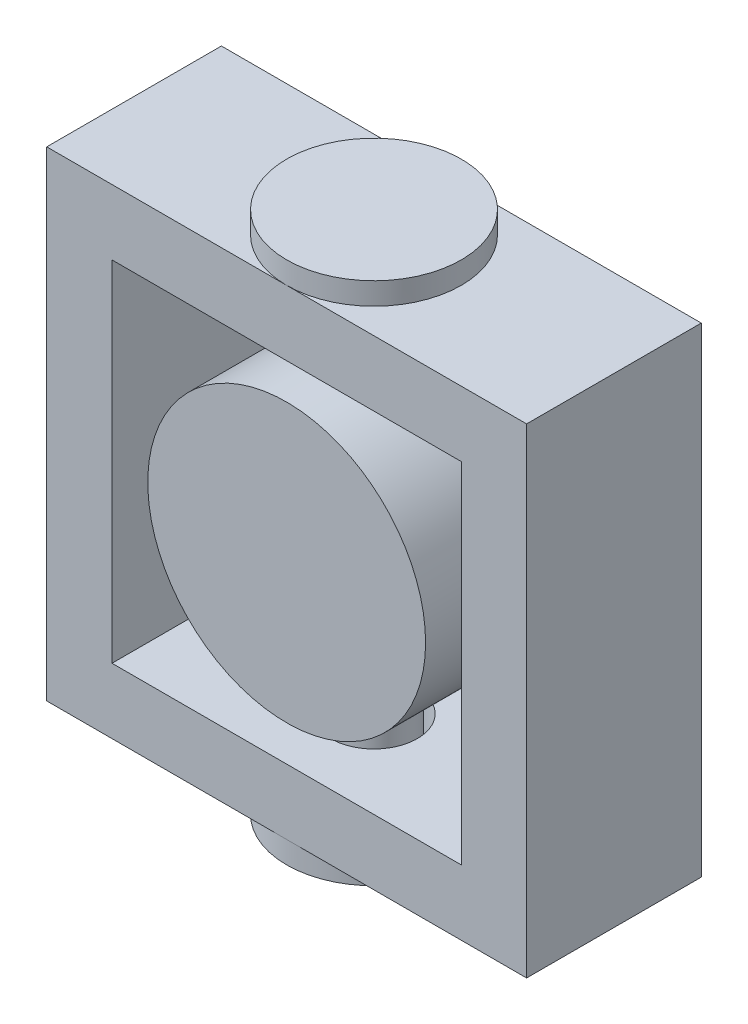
ISO-10303-21;
HEADER;
FILE_DESCRIPTION(('STEP AP214'),'2;1');
FILE_NAME('part.step','',(''),(''),'','','');
FILE_SCHEMA(('AUTOMOTIVE_DESIGN { 1 0 10303 214 1 1 1 1 }'));
ENDSEC;
DATA;
#1=APPLICATION_CONTEXT('core data for automotive mechanical design processes');
#2=APPLICATION_PROTOCOL_DEFINITION('international standard','automotive_design',2000,#1);
#3=PRODUCT_CONTEXT('',#1,'mechanical');
#4=PRODUCT('Part','Part','',(#3));
#5=PRODUCT_RELATED_PRODUCT_CATEGORY('part','',(#4));
#6=PRODUCT_DEFINITION_FORMATION('','',#4);
#7=PRODUCT_DEFINITION_CONTEXT('part definition',#1,'design');
#8=PRODUCT_DEFINITION('design','',#6,#7);
#9=PRODUCT_DEFINITION_SHAPE('','',#8);
#10=(LENGTH_UNIT() NAMED_UNIT(*) SI_UNIT(.MILLI.,.METRE.));
#11=(NAMED_UNIT(*) PLANE_ANGLE_UNIT() SI_UNIT($,.RADIAN.));
#12=(NAMED_UNIT(*) SI_UNIT($,.STERADIAN.) SOLID_ANGLE_UNIT());
#13=UNCERTAINTY_MEASURE_WITH_UNIT(LENGTH_MEASURE(1.E-05),#10,'distance_accuracy_value','');
#14=(GEOMETRIC_REPRESENTATION_CONTEXT(3) GLOBAL_UNCERTAINTY_ASSIGNED_CONTEXT((#13)) GLOBAL_UNIT_ASSIGNED_CONTEXT((#10,
#11,#12)) REPRESENTATION_CONTEXT('',''));
#15=CARTESIAN_POINT('',(0.,0.,0.));
#16=DIRECTION('',(0.,0.,1.));
#17=DIRECTION('',(1.,0.,0.));
#18=AXIS2_PLACEMENT_3D('',#15,#16,#17);
#19=CARTESIAN_POINT('',(0.,0.,0.));
#20=DIRECTION('',(0.,0.,1.));
#21=DIRECTION('',(1.,0.,0.));
#22=AXIS2_PLACEMENT_3D('',#19,#20,#21);
#23=CYLINDRICAL_SURFACE('',#22,7.95313971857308);
#24=CARTESIAN_POINT('',(0.,7.95313971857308,2.52184889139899));
#25=CARTESIAN_POINT('',(-0.135701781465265,7.95313900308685,2.52184983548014));
#26=CARTESIAN_POINT('',(-0.271413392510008,7.94963375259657,2.53303203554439));
#27=CARTESIAN_POINT('',(-0.538869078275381,7.93599396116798,2.577348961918));
#28=CARTESIAN_POINT('',(-0.670612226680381,7.9258578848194,2.61048877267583));
#29=CARTESIAN_POINT('',(-0.926235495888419,7.90006398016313,2.69749577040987));
#30=CARTESIAN_POINT('',(-1.05012740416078,7.88441467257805,2.75133098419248));
#31=CARTESIAN_POINT('',(-1.28712560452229,7.8492109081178,2.87806493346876));
#32=CARTESIAN_POINT('',(-1.40023021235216,7.8296558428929,2.95096663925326));
#33=CARTESIAN_POINT('',(-1.61591884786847,7.78804501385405,3.1161221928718));
#34=CARTESIAN_POINT('',(-1.71812489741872,7.76593500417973,3.20885595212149));
#35=CARTESIAN_POINT('',(-1.90581506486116,7.72202111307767,3.41002133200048));
#36=CARTESIAN_POINT('',(-1.99129609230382,7.70021728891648,3.51845584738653));
#37=CARTESIAN_POINT('',(-2.14515479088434,7.65880300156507,3.75121141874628));
#38=CARTESIAN_POINT('',(-2.21306107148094,7.63925952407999,3.8758571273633));
#39=CARTESIAN_POINT('',(-2.32679110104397,7.6053942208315,4.13550667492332));
#40=CARTESIAN_POINT('',(-2.37262062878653,7.59107102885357,4.27050779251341));
#41=CARTESIAN_POINT('',(-2.43951463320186,7.56983528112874,4.54277228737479));
#42=CARTESIAN_POINT('',(-2.46127994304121,7.56271355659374,4.67984670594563));
#43=CARTESIAN_POINT('',(-2.48161709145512,7.55606597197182,4.955872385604));
#44=CARTESIAN_POINT('',(-2.48019505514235,7.55653810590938,5.09482314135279));
#45=CARTESIAN_POINT('',(-2.45474619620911,7.56484020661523,5.36486715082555));
#46=CARTESIAN_POINT('',(-2.43160933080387,7.57238047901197,5.49605467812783));
#47=CARTESIAN_POINT('',(-2.3648301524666,7.59349878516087,5.75258456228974));
#48=CARTESIAN_POINT('',(-2.32118567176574,7.60707745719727,5.87792629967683));
#49=CARTESIAN_POINT('',(-2.21399969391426,7.63896528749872,6.12133085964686));
#50=CARTESIAN_POINT('',(-2.15017807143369,7.65734036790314,6.23926131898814));
#51=CARTESIAN_POINT('',(-2.00464403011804,7.69672029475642,6.46303122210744));
#52=CARTESIAN_POINT('',(-1.92292698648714,7.71772582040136,6.56886752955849));
#53=CARTESIAN_POINT('',(-1.73955080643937,7.76116295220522,6.7704773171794));
#54=CARTESIAN_POINT('',(-1.63715669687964,7.78361608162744,6.86557888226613));
#55=CARTESIAN_POINT('',(-1.41759410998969,7.82658004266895,7.03742370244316));
#56=CARTESIAN_POINT('',(-1.30042455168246,7.8470907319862,7.11416561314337));
#57=CARTESIAN_POINT('',(-1.05334760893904,7.88407205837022,7.24756447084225));
#58=CARTESIAN_POINT('',(-0.923348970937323,7.9005103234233,7.30406198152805));
#59=CARTESIAN_POINT('',(-0.655061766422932,7.92726100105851,7.39418782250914));
#60=CARTESIAN_POINT('',(-0.516775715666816,7.9375752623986,7.42782305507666));
#61=CARTESIAN_POINT('',(-0.24154314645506,7.95061868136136,7.47012688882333));
#62=CARTESIAN_POINT('',(-0.104749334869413,7.95362406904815,7.47970517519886));
#63=CARTESIAN_POINT('',(0.168505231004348,7.95252759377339,7.4761869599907));
#64=CARTESIAN_POINT('',(0.304966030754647,7.94842676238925,7.46309374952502));
#65=CARTESIAN_POINT('',(0.570177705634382,7.93376008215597,7.41533489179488));
#66=CARTESIAN_POINT('',(0.699035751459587,7.92335634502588,7.38120981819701));
#67=CARTESIAN_POINT('',(0.949161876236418,7.89730009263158,7.29301485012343));
#68=CARTESIAN_POINT('',(1.0704290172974,7.88164693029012,7.23894249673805));
#69=CARTESIAN_POINT('',(1.30520713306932,7.8462291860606,7.11091899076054));
#70=CARTESIAN_POINT('',(1.41845814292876,7.82637396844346,7.03651686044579));
#71=CARTESIAN_POINT('',(1.63117290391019,7.78482316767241,6.87048738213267));
#72=CARTESIAN_POINT('',(1.73063292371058,7.76312708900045,6.77885538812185));
#73=CARTESIAN_POINT('',(1.91700762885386,7.71926480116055,6.5766889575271));
#74=CARTESIAN_POINT('',(2.00327403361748,7.69711372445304,6.46555224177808));
#75=CARTESIAN_POINT('',(2.15598986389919,7.65574429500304,6.22989864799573));
#76=CARTESIAN_POINT('',(2.22243962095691,7.63652589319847,6.10538199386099));
#77=CARTESIAN_POINT('',(2.33321942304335,7.60341164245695,5.84677135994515));
#78=CARTESIAN_POINT('',(2.37763654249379,7.58949489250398,5.71271751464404));
#79=CARTESIAN_POINT('',(2.44311065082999,7.5686752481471,5.4385114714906));
#80=CARTESIAN_POINT('',(2.46417646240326,7.56176970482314,5.29836159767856));
#81=CARTESIAN_POINT('',(2.48171887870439,7.55602926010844,5.02271574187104));
#82=CARTESIAN_POINT('',(2.47925847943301,7.55684544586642,4.8872938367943));
#83=CARTESIAN_POINT('',(2.45238230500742,7.56560953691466,4.61889360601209));
#84=CARTESIAN_POINT('',(2.42796754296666,7.57355711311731,4.48591516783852));
#85=CARTESIAN_POINT('',(2.35858542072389,7.59544539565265,4.22806542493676));
#86=CARTESIAN_POINT('',(2.3139205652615,7.60929771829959,4.10310465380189));
#87=CARTESIAN_POINT('',(2.20554412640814,7.64141257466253,3.86235103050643));
#88=CARTESIAN_POINT('',(2.14182868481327,7.65967600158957,3.74656004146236));
#89=CARTESIAN_POINT('',(1.99425878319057,7.69944224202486,3.52255396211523));
#90=CARTESIAN_POINT('',(1.90971693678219,7.72104347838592,3.41480922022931));
#91=CARTESIAN_POINT('',(1.72410564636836,7.76459693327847,3.21469154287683));
#92=CARTESIAN_POINT('',(1.62303179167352,7.78654924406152,3.12232272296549));
#93=CARTESIAN_POINT('',(1.40328555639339,7.829184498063,2.95258438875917));
#94=CARTESIAN_POINT('',(1.284149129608,7.84980327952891,2.87579773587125));
#95=CARTESIAN_POINT('',(1.03401652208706,7.88664592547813,2.74344437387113));
#96=CARTESIAN_POINT('',(0.903025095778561,7.90287154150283,2.68786920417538));
#97=CARTESIAN_POINT('',(0.644563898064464,7.92794742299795,2.6036226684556));
#98=CARTESIAN_POINT('',(0.517763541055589,7.93731279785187,2.57304545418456));
#99=CARTESIAN_POINT('',(0.260644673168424,7.94990867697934,2.5321601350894));
#100=CARTESIAN_POINT('',(0.130326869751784,7.95314040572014,2.52184798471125));
#101=CARTESIAN_POINT('',(0.,7.95313971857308,2.52184889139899));
#102=B_SPLINE_CURVE_WITH_KNOTS('',3,(#24,#25,#26,#27,#28,#29,#30,#31,#32,#33,#34,#35,#36,#37,
#38,#39,#40,#41,#42,#43,#44,#45,#46,#47,#48,#49,#50,#51,#52,#53,#54,#55,#56,#57,#58,#59,#60,#61,
#62,#63,#64,#65,#66,#67,#68,#69,#70,#71,#72,#73,#74,#75,#76,#77,#78,#79,#80,#81,#82,#83,#84,#85,
#86,#87,#88,#89,#90,#91,#92,#93,#94,#95,#96,#97,#98,#99,#100,#101),.UNSPECIFIED.,.T.,.F.,(4,2,2,
2,2,2,2,2,2,2,2,2,2,2,2,2,2,2,2,2,2,2,2,2,2,2,2,2,2,2,2,2,2,2,2,2,2,2,4),(0.,0.406626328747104,
0.813346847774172,1.2194415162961,1.62559948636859,2.04300256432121,2.46048269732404,
2.88821164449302,3.31582856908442,3.7306339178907,4.14532969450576,4.54373901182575,
4.94219045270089,5.34643643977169,5.75078702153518,6.17343170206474,6.59610732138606,
7.02204215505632,7.44784833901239,7.85729284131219,8.26667791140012,8.66595584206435,
9.06528300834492,9.47431040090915,9.88344824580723,10.3086980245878,10.7339406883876,
11.1574891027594,11.5808774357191,11.9852293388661,12.3895625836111,12.7880451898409,
13.1866085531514,13.6006863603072,14.0148748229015,14.4424813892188,14.8699172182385,
15.2605157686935,15.6510363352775),.UNSPECIFIED.);
#103=CARTESIAN_POINT('',(0.,7.95313971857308,2.52184889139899));
#104=VERTEX_POINT('',#103);
#105=EDGE_CURVE('E45',#104,#104,#102,.T.);
#106=ORIENTED_EDGE('',*,*,#105,.F.);
#107=EDGE_LOOP('',(#106));
#108=FACE_BOUND('',#107,.T.);
#109=CARTESIAN_POINT('',(0.,-7.95313971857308,2.52184889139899));
#110=CARTESIAN_POINT('',(0.135701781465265,-7.95313900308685,2.52184983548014));
#111=CARTESIAN_POINT('',(0.271413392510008,-7.94963375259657,2.53303203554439));
#112=CARTESIAN_POINT('',(0.538869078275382,-7.93599396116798,2.577348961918));
#113=CARTESIAN_POINT('',(0.670612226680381,-7.9258578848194,2.61048877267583));
#114=CARTESIAN_POINT('',(0.92623549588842,-7.90006398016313,2.69749577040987));
#115=CARTESIAN_POINT('',(1.05012740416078,-7.88441467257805,2.75133098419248));
#116=CARTESIAN_POINT('',(1.28712560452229,-7.8492109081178,2.87806493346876));
#117=CARTESIAN_POINT('',(1.40023021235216,-7.8296558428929,2.95096663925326));
#118=CARTESIAN_POINT('',(1.61591884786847,-7.78804501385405,3.1161221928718));
#119=CARTESIAN_POINT('',(1.71812489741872,-7.76593500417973,3.20885595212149));
#120=CARTESIAN_POINT('',(1.90581506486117,-7.72202111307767,3.41002133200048));
#121=CARTESIAN_POINT('',(1.99129609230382,-7.70021728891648,3.51845584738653));
#122=CARTESIAN_POINT('',(2.14515479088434,-7.65880300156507,3.75121141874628));
#123=CARTESIAN_POINT('',(2.21306107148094,-7.63925952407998,3.8758571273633));
#124=CARTESIAN_POINT('',(2.32679110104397,-7.6053942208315,4.13550667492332));
#125=CARTESIAN_POINT('',(2.37262062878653,-7.59107102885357,4.27050779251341));
#126=CARTESIAN_POINT('',(2.43951463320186,-7.56983528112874,4.54277228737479));
#127=CARTESIAN_POINT('',(2.46127994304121,-7.56271355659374,4.67984670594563));
#128=CARTESIAN_POINT('',(2.48161709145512,-7.55606597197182,4.955872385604));
#129=CARTESIAN_POINT('',(2.48019505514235,-7.55653810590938,5.09482314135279));
#130=CARTESIAN_POINT('',(2.45474619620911,-7.56484020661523,5.36486715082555));
#131=CARTESIAN_POINT('',(2.43160933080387,-7.57238047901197,5.49605467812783));
#132=CARTESIAN_POINT('',(2.3648301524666,-7.59349878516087,5.75258456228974));
#133=CARTESIAN_POINT('',(2.32118567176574,-7.60707745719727,5.87792629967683));
#134=CARTESIAN_POINT('',(2.21399969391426,-7.63896528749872,6.12133085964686));
#135=CARTESIAN_POINT('',(2.15017807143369,-7.65734036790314,6.23926131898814));
#136=CARTESIAN_POINT('',(2.00464403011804,-7.69672029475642,6.46303122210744));
#137=CARTESIAN_POINT('',(1.92292698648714,-7.71772582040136,6.56886752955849));
#138=CARTESIAN_POINT('',(1.73955080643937,-7.76116295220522,6.7704773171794));
#139=CARTESIAN_POINT('',(1.63715669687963,-7.78361608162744,6.86557888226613));
#140=CARTESIAN_POINT('',(1.41759410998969,-7.82658004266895,7.03742370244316));
#141=CARTESIAN_POINT('',(1.30042455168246,-7.8470907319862,7.11416561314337));
#142=CARTESIAN_POINT('',(1.05334760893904,-7.88407205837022,7.24756447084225));
#143=CARTESIAN_POINT('',(0.923348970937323,-7.9005103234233,7.30406198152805));
#144=CARTESIAN_POINT('',(0.655061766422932,-7.92726100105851,7.39418782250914));
#145=CARTESIAN_POINT('',(0.516775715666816,-7.9375752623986,7.42782305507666));
#146=CARTESIAN_POINT('',(0.241543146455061,-7.95061868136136,7.47012688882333));
#147=CARTESIAN_POINT('',(0.104749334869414,-7.95362406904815,7.47970517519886));
#148=CARTESIAN_POINT('',(-0.168505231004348,-7.95252759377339,7.4761869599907));
#149=CARTESIAN_POINT('',(-0.304966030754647,-7.94842676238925,7.46309374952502));
#150=CARTESIAN_POINT('',(-0.570177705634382,-7.93376008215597,7.41533489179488));
#151=CARTESIAN_POINT('',(-0.699035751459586,-7.92335634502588,7.38120981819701));
#152=CARTESIAN_POINT('',(-0.949161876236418,-7.89730009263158,7.29301485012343));
#153=CARTESIAN_POINT('',(-1.0704290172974,-7.88164693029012,7.23894249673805));
#154=CARTESIAN_POINT('',(-1.30520713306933,-7.8462291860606,7.11091899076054));
#155=CARTESIAN_POINT('',(-1.41845814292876,-7.82637396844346,7.03651686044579));
#156=CARTESIAN_POINT('',(-1.63117290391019,-7.78482316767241,6.87048738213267));
#157=CARTESIAN_POINT('',(-1.73063292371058,-7.76312708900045,6.77885538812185));
#158=CARTESIAN_POINT('',(-1.91700762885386,-7.71926480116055,6.5766889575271));
#159=CARTESIAN_POINT('',(-2.00327403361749,-7.69711372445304,6.46555224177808));
#160=CARTESIAN_POINT('',(-2.15598986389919,-7.65574429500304,6.22989864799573));
#161=CARTESIAN_POINT('',(-2.22243962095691,-7.63652589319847,6.10538199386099));
#162=CARTESIAN_POINT('',(-2.33321942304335,-7.60341164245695,5.84677135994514));
#163=CARTESIAN_POINT('',(-2.37763654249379,-7.58949489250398,5.71271751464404));
#164=CARTESIAN_POINT('',(-2.44311065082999,-7.5686752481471,5.4385114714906));
#165=CARTESIAN_POINT('',(-2.46417646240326,-7.56176970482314,5.29836159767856));
#166=CARTESIAN_POINT('',(-2.48171887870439,-7.55602926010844,5.02271574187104));
#167=CARTESIAN_POINT('',(-2.47925847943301,-7.55684544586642,4.8872938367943));
#168=CARTESIAN_POINT('',(-2.45238230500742,-7.56560953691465,4.61889360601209));
#169=CARTESIAN_POINT('',(-2.42796754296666,-7.57355711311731,4.48591516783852));
#170=CARTESIAN_POINT('',(-2.35858542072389,-7.59544539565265,4.22806542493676));
#171=CARTESIAN_POINT('',(-2.3139205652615,-7.60929771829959,4.10310465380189));
#172=CARTESIAN_POINT('',(-2.20554412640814,-7.64141257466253,3.86235103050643));
#173=CARTESIAN_POINT('',(-2.14182868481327,-7.65967600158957,3.74656004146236));
#174=CARTESIAN_POINT('',(-1.99425878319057,-7.69944224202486,3.52255396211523));
#175=CARTESIAN_POINT('',(-1.90971693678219,-7.72104347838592,3.41480922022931));
#176=CARTESIAN_POINT('',(-1.72410564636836,-7.76459693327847,3.21469154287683));
#177=CARTESIAN_POINT('',(-1.62303179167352,-7.78654924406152,3.12232272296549));
#178=CARTESIAN_POINT('',(-1.40328555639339,-7.829184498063,2.95258438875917));
#179=CARTESIAN_POINT('',(-1.284149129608,-7.84980327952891,2.87579773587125));
#180=CARTESIAN_POINT('',(-1.03401652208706,-7.88664592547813,2.74344437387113));
#181=CARTESIAN_POINT('',(-0.903025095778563,-7.90287154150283,2.68786920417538));
#182=CARTESIAN_POINT('',(-0.644563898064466,-7.92794742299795,2.6036226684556));
#183=CARTESIAN_POINT('',(-0.517763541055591,-7.93731279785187,2.57304545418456));
#184=CARTESIAN_POINT('',(-0.260644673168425,-7.94990867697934,2.5321601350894));
#185=CARTESIAN_POINT('',(-0.130326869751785,-7.95314040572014,2.52184798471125));
#186=CARTESIAN_POINT('',(0.,-7.95313971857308,2.52184889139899));
#187=B_SPLINE_CURVE_WITH_KNOTS('',3,(#109,#110,#111,#112,#113,#114,#115,#116,#117,#118,#119,
#120,#121,#122,#123,#124,#125,#126,#127,#128,#129,#130,#131,#132,#133,#134,#135,#136,#137,#138,
#139,#140,#141,#142,#143,#144,#145,#146,#147,#148,#149,#150,#151,#152,#153,#154,#155,#156,#157,
#158,#159,#160,#161,#162,#163,#164,#165,#166,#167,#168,#169,#170,#171,#172,#173,#174,#175,#176,
#177,#178,#179,#180,#181,#182,#183,#184,#185,#186),.UNSPECIFIED.,.T.,.F.,(4,2,2,2,2,2,2,2,2,2,2,
2,2,2,2,2,2,2,2,2,2,2,2,2,2,2,2,2,2,2,2,2,2,2,2,2,2,2,4),(0.,0.406626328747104,
0.813346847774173,1.2194415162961,1.6255994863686,2.04300256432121,2.46048269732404,
2.88821164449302,3.31582856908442,3.7306339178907,4.14532969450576,4.54373901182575,
4.94219045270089,5.3464364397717,5.75078702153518,6.17343170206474,6.59610732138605,
7.02204215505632,7.44784833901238,7.85729284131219,8.26667791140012,8.66595584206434,
9.06528300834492,9.47431040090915,9.88344824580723,10.3086980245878,10.7339406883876,
11.1574891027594,11.5808774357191,11.9852293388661,12.3895625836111,12.7880451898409,
13.1866085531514,13.6006863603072,14.0148748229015,14.4424813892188,14.8699172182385,
15.2605157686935,15.6510363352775),.UNSPECIFIED.);
#188=CARTESIAN_POINT('',(0.,-7.95313971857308,2.52184889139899));
#189=VERTEX_POINT('',#188);
#190=EDGE_CURVE('E58',#189,#189,#187,.T.);
#191=ORIENTED_EDGE('',*,*,#190,.F.);
#192=EDGE_LOOP('',(#191));
#193=FACE_BOUND('',#192,.T.);
#194=CARTESIAN_POINT('',(0.,0.,0.));
#195=DIRECTION('',(0.,0.,1.));
#196=DIRECTION('',(1.,0.,0.));
#197=AXIS2_PLACEMENT_3D('',#194,#195,#196);
#198=CIRCLE('',#197,7.95313971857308);
#199=CARTESIAN_POINT('',(7.95313971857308,0.,0.));
#200=VERTEX_POINT('',#199);
#201=EDGE_CURVE('E11',#200,#200,#198,.T.);
#202=ORIENTED_EDGE('',*,*,#201,.T.);
#203=EDGE_LOOP('',(#202));
#204=FACE_BOUND('',#203,.T.);
#205=CARTESIAN_POINT('',(0.,0.,10.));
#206=DIRECTION('',(0.,0.,1.));
#207=DIRECTION('',(1.,0.,0.));
#208=AXIS2_PLACEMENT_3D('',#205,#206,#207);
#209=CIRCLE('',#208,7.95313971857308);
#210=CARTESIAN_POINT('',(7.95313971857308,0.,10.));
#211=VERTEX_POINT('',#210);
#212=EDGE_CURVE('E52',#211,#211,#209,.T.);
#213=ORIENTED_EDGE('',*,*,#212,.F.);
#214=EDGE_LOOP('',(#213));
#215=FACE_BOUND('',#214,.T.);
#216=ADVANCED_FACE('F41',(#108,#193,#204,#215),#23,.T.);
#217=CARTESIAN_POINT('',(0.,0.,0.));
#218=DIRECTION('',(0.,0.,1.));
#219=DIRECTION('',(1.,0.,0.));
#220=AXIS2_PLACEMENT_3D('',#217,#218,#219);
#221=PLANE('',#220);
#222=ORIENTED_EDGE('',*,*,#201,.F.);
#223=EDGE_LOOP('',(#222));
#224=FACE_BOUND('',#223,.T.);
#225=ADVANCED_FACE('F68',(#224),#221,.F.);
#226=CARTESIAN_POINT('',(0.,0.,10.));
#227=DIRECTION('',(0.,0.,1.));
#228=DIRECTION('',(1.,0.,0.));
#229=AXIS2_PLACEMENT_3D('',#226,#227,#228);
#230=PLANE('',#229);
#231=ORIENTED_EDGE('',*,*,#212,.T.);
#232=EDGE_LOOP('',(#231));
#233=FACE_BOUND('',#232,.T.);
#234=ADVANCED_FACE('F66',(#233),#230,.T.);
#235=CARTESIAN_POINT('',(0.,15.2628414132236,5.));
#236=DIRECTION('',(0.,-1.,0.));
#237=DIRECTION('',(0.,0.,-1.));
#238=AXIS2_PLACEMENT_3D('',#235,#236,#237);
#239=CYLINDRICAL_SURFACE('',#238,2.47815110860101);
#240=ORIENTED_EDGE('',*,*,#105,.T.);
#241=EDGE_LOOP('',(#240));
#242=FACE_BOUND('',#241,.T.);
#243=ORIENTED_EDGE('',*,*,#190,.T.);
#244=EDGE_LOOP('',(#243));
#245=FACE_BOUND('',#244,.T.);
#246=ADVANCED_FACE('F62',(#242,#245),#239,.F.);
#247=CLOSED_SHELL('',(#216,#225,#234,#246));
#248=MANIFOLD_SOLID_BREP('B2',#247);
#249=CARTESIAN_POINT('',(13.7371585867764,13.7371585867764,10.));
#250=DIRECTION('',(0.,-1.,0.));
#251=DIRECTION('',(0.,0.,-1.));
#252=AXIS2_PLACEMENT_3D('',#249,#250,#251);
#253=PLANE('',#252);
#254=DIRECTION('',(-1.,0.,0.));
#255=VECTOR('',#254,1.);
#256=CARTESIAN_POINT('',(13.7371585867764,13.7371585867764,0.));
#257=LINE('',#256,#255);
#258=CARTESIAN_POINT('',(13.7371585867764,13.7371585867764,0.));
#259=VERTEX_POINT('',#258);
#260=CARTESIAN_POINT('',(0.,13.7371585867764,0.));
#261=VERTEX_POINT('',#260);
#262=EDGE_CURVE('E196',#259,#261,#257,.T.);
#263=ORIENTED_EDGE('',*,*,#262,.T.);
#264=CARTESIAN_POINT('',(0.,13.7371585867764,5.));
#265=DIRECTION('',(0.,-1.,0.));
#266=DIRECTION('',(0.,0.,-1.));
#267=AXIS2_PLACEMENT_3D('',#264,#265,#266);
#268=CIRCLE('',#267,5.);
#269=CARTESIAN_POINT('',(0.,13.7371585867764,10.));
#270=VERTEX_POINT('',#269);
#271=EDGE_CURVE('E39',#261,#270,#268,.T.);
#272=ORIENTED_EDGE('',*,*,#271,.T.);
#273=DIRECTION('',(-1.,0.,0.));
#274=VECTOR('',#273,1.);
#275=CARTESIAN_POINT('',(13.7371585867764,13.7371585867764,10.));
#276=LINE('',#275,#274);
#277=CARTESIAN_POINT('',(13.7371585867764,13.7371585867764,10.));
#278=VERTEX_POINT('',#277);
#279=EDGE_CURVE('E194',#278,#270,#276,.T.);
#280=ORIENTED_EDGE('',*,*,#279,.F.);
#281=DIRECTION('',(0.,0.,-1.));
#282=VECTOR('',#281,1.);
#283=CARTESIAN_POINT('',(13.7371585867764,13.7371585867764,10.));
#284=LINE('',#283,#282);
#285=EDGE_CURVE('E211',#278,#259,#284,.T.);
#286=ORIENTED_EDGE('',*,*,#285,.T.);
#287=EDGE_LOOP('',(#263,#272,#280,#286));
#288=FACE_BOUND('',#287,.T.);
#289=ADVANCED_FACE('F111',(#288),#253,.F.);
#290=CARTESIAN_POINT('',(13.7371585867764,-13.7371585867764,10.));
#291=DIRECTION('',(0.,1.,0.));
#292=DIRECTION('',(0.,0.,1.));
#293=AXIS2_PLACEMENT_3D('',#290,#291,#292);
#294=PLANE('',#293);
#295=CARTESIAN_POINT('',(0.,-13.7371585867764,5.));
#296=DIRECTION('',(0.,1.,0.));
#297=DIRECTION('',(0.,0.,1.));
#298=AXIS2_PLACEMENT_3D('',#295,#296,#297);
#299=CIRCLE('',#298,5.);
#300=CARTESIAN_POINT('',(0.,-13.7371585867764,10.));
#301=VERTEX_POINT('',#300);
#302=CARTESIAN_POINT('',(0.,-13.7371585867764,0.));
#303=VERTEX_POINT('',#302);
#304=EDGE_CURVE('E188',#301,#303,#299,.F.);
#305=ORIENTED_EDGE('',*,*,#304,.F.);
#306=DIRECTION('',(1.,0.,0.));
#307=VECTOR('',#306,1.);
#308=CARTESIAN_POINT('',(13.7371585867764,-13.7371585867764,10.));
#309=LINE('',#308,#307);
#310=CARTESIAN_POINT('',(-13.7371585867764,-13.7371585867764,10.));
#311=VERTEX_POINT('',#310);
#312=EDGE_CURVE('E295',#311,#301,#309,.T.);
#313=ORIENTED_EDGE('',*,*,#312,.F.);
#314=DIRECTION('',(0.,0.,-1.));
#315=VECTOR('',#314,1.);
#316=CARTESIAN_POINT('',(-13.7371585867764,-13.7371585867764,10.));
#317=LINE('',#316,#315);
#318=CARTESIAN_POINT('',(-13.7371585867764,-13.7371585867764,0.));
#319=VERTEX_POINT('',#318);
#320=EDGE_CURVE('E233',#311,#319,#317,.T.);
#321=ORIENTED_EDGE('',*,*,#320,.T.);
#322=DIRECTION('',(1.,0.,0.));
#323=VECTOR('',#322,1.);
#324=CARTESIAN_POINT('',(13.7371585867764,-13.7371585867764,0.));
#325=LINE('',#324,#323);
#326=EDGE_CURVE('E221',#319,#303,#325,.T.);
#327=ORIENTED_EDGE('',*,*,#326,.T.);
#328=EDGE_LOOP('',(#305,#313,#321,#327));
#329=FACE_BOUND('',#328,.T.);
#330=ADVANCED_FACE('F309',(#329),#294,.F.);
#331=CARTESIAN_POINT('',(0.,0.,10.));
#332=DIRECTION('',(0.,0.,1.));
#333=DIRECTION('',(1.,0.,0.));
#334=AXIS2_PLACEMENT_3D('',#331,#332,#333);
#335=PLANE('',#334);
#336=ORIENTED_EDGE('',*,*,#279,.T.);
#337=CARTESIAN_POINT('',(-13.7371585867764,13.7371585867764,10.));
#338=VERTEX_POINT('',#337);
#339=EDGE_CURVE('E198',#270,#338,#276,.T.);
#340=ORIENTED_EDGE('',*,*,#339,.T.);
#341=DIRECTION('',(0.,-1.,0.));
#342=VECTOR('',#341,1.);
#343=CARTESIAN_POINT('',(-13.7371585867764,-13.7371585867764,10.));
#344=LINE('',#343,#342);
#345=EDGE_CURVE('E227',#338,#311,#344,.T.);
#346=ORIENTED_EDGE('',*,*,#345,.T.);
#347=ORIENTED_EDGE('',*,*,#312,.T.);
#348=CARTESIAN_POINT('',(13.7371585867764,-13.7371585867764,10.));
#349=VERTEX_POINT('',#348);
#350=EDGE_CURVE('E294',#301,#349,#309,.T.);
#351=ORIENTED_EDGE('',*,*,#350,.T.);
#352=DIRECTION('',(0.,1.,0.));
#353=VECTOR('',#352,1.);
#354=CARTESIAN_POINT('',(13.7371585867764,-13.7371585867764,10.));
#355=LINE('',#354,#353);
#356=EDGE_CURVE('E205',#349,#278,#355,.T.);
#357=ORIENTED_EDGE('',*,*,#356,.T.);
#358=EDGE_LOOP('',(#336,#340,#346,#347,#351,#357));
#359=FACE_BOUND('',#358,.T.);
#360=DIRECTION('',(-1.,0.,0.));
#361=VECTOR('',#360,1.);
#362=CARTESIAN_POINT('',(-10.,10.,10.));
#363=LINE('',#362,#361);
#364=CARTESIAN_POINT('',(10.,10.,10.));
#365=VERTEX_POINT('',#364);
#366=CARTESIAN_POINT('',(-10.,10.,10.));
#367=VERTEX_POINT('',#366);
#368=EDGE_CURVE('E267',#365,#367,#363,.T.);
#369=ORIENTED_EDGE('',*,*,#368,.F.);
#370=DIRECTION('',(0.,1.,0.));
#371=VECTOR('',#370,1.);
#372=CARTESIAN_POINT('',(10.,10.,10.));
#373=LINE('',#372,#371);
#374=CARTESIAN_POINT('',(10.,-10.,10.));
#375=VERTEX_POINT('',#374);
#376=EDGE_CURVE('E265',#375,#365,#373,.T.);
#377=ORIENTED_EDGE('',*,*,#376,.F.);
#378=DIRECTION('',(1.,0.,0.));
#379=VECTOR('',#378,1.);
#380=CARTESIAN_POINT('',(-10.,-10.,10.));
#381=LINE('',#380,#379);
#382=CARTESIAN_POINT('',(-10.,-10.,10.));
#383=VERTEX_POINT('',#382);
#384=EDGE_CURVE('E273',#383,#375,#381,.T.);
#385=ORIENTED_EDGE('',*,*,#384,.F.);
#386=DIRECTION('',(0.,-1.,0.));
#387=VECTOR('',#386,1.);
#388=CARTESIAN_POINT('',(-10.,10.,10.));
#389=LINE('',#388,#387);
#390=EDGE_CURVE('E270',#367,#383,#389,.T.);
#391=ORIENTED_EDGE('',*,*,#390,.F.);
#392=EDGE_LOOP('',(#369,#377,#385,#391));
#393=FACE_BOUND('',#392,.T.);
#394=ADVANCED_FACE('F207',(#359,#393),#335,.T.);
#395=CARTESIAN_POINT('',(0.,0.,0.));
#396=DIRECTION('',(0.,0.,1.));
#397=DIRECTION('',(1.,0.,0.));
#398=AXIS2_PLACEMENT_3D('',#395,#396,#397);
#399=PLANE('',#398);
#400=CARTESIAN_POINT('',(-13.7371585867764,13.7371585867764,0.));
#401=VERTEX_POINT('',#400);
#402=EDGE_CURVE('E226',#261,#401,#257,.T.);
#403=ORIENTED_EDGE('',*,*,#402,.F.);
#404=ORIENTED_EDGE('',*,*,#262,.F.);
#405=DIRECTION('',(0.,1.,0.));
#406=VECTOR('',#405,1.);
#407=CARTESIAN_POINT('',(13.7371585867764,-13.7371585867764,0.));
#408=LINE('',#407,#406);
#409=CARTESIAN_POINT('',(13.7371585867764,-13.7371585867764,0.));
#410=VERTEX_POINT('',#409);
#411=EDGE_CURVE('E224',#410,#259,#408,.T.);
#412=ORIENTED_EDGE('',*,*,#411,.F.);
#413=EDGE_CURVE('E219',#303,#410,#325,.T.);
#414=ORIENTED_EDGE('',*,*,#413,.F.);
#415=ORIENTED_EDGE('',*,*,#326,.F.);
#416=DIRECTION('',(0.,-1.,0.));
#417=VECTOR('',#416,1.);
#418=CARTESIAN_POINT('',(-13.7371585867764,-13.7371585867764,0.));
#419=LINE('',#418,#417);
#420=EDGE_CURVE('E216',#401,#319,#419,.T.);
#421=ORIENTED_EDGE('',*,*,#420,.F.);
#422=EDGE_LOOP('',(#403,#404,#412,#414,#415,#421));
#423=FACE_BOUND('',#422,.T.);
#424=DIRECTION('',(0.,1.,0.));
#425=VECTOR('',#424,1.);
#426=CARTESIAN_POINT('',(10.,10.,0.));
#427=LINE('',#426,#425);
#428=CARTESIAN_POINT('',(10.,-10.,0.));
#429=VERTEX_POINT('',#428);
#430=CARTESIAN_POINT('',(10.,10.,0.));
#431=VERTEX_POINT('',#430);
#432=EDGE_CURVE('E264',#429,#431,#427,.T.);
#433=ORIENTED_EDGE('',*,*,#432,.T.);
#434=DIRECTION('',(-1.,0.,0.));
#435=VECTOR('',#434,1.);
#436=CARTESIAN_POINT('',(-10.,10.,0.));
#437=LINE('',#436,#435);
#438=CARTESIAN_POINT('',(-10.,10.,0.));
#439=VERTEX_POINT('',#438);
#440=EDGE_CURVE('E278',#431,#439,#437,.T.);
#441=ORIENTED_EDGE('',*,*,#440,.T.);
#442=DIRECTION('',(0.,-1.,0.));
#443=VECTOR('',#442,1.);
#444=CARTESIAN_POINT('',(-10.,10.,0.));
#445=LINE('',#444,#443);
#446=CARTESIAN_POINT('',(-10.,-10.,0.));
#447=VERTEX_POINT('',#446);
#448=EDGE_CURVE('E281',#439,#447,#445,.T.);
#449=ORIENTED_EDGE('',*,*,#448,.T.);
#450=DIRECTION('',(1.,0.,0.));
#451=VECTOR('',#450,1.);
#452=CARTESIAN_POINT('',(-10.,-10.,0.));
#453=LINE('',#452,#451);
#454=EDGE_CURVE('E268',#447,#429,#453,.T.);
#455=ORIENTED_EDGE('',*,*,#454,.T.);
#456=EDGE_LOOP('',(#433,#441,#449,#455));
#457=FACE_BOUND('',#456,.T.);
#458=ADVANCED_FACE('F303',(#423,#457),#399,.F.);
#459=CARTESIAN_POINT('',(-13.7371585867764,-13.7371585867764,10.));
#460=DIRECTION('',(1.,0.,0.));
#461=DIRECTION('',(0.,0.,-1.));
#462=AXIS2_PLACEMENT_3D('',#459,#460,#461);
#463=PLANE('',#462);
#464=ORIENTED_EDGE('',*,*,#420,.T.);
#465=ORIENTED_EDGE('',*,*,#320,.F.);
#466=ORIENTED_EDGE('',*,*,#345,.F.);
#467=DIRECTION('',(0.,0.,-1.));
#468=VECTOR('',#467,1.);
#469=CARTESIAN_POINT('',(-13.7371585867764,13.7371585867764,10.));
#470=LINE('',#469,#468);
#471=EDGE_CURVE('E201',#338,#401,#470,.T.);
#472=ORIENTED_EDGE('',*,*,#471,.T.);
#473=EDGE_LOOP('',(#464,#465,#466,#472));
#474=FACE_BOUND('',#473,.T.);
#475=ADVANCED_FACE('F113',(#474),#463,.F.);
#476=EDGE_CURVE('E131',#303,#301,#299,.F.);
#477=ORIENTED_EDGE('',*,*,#476,.F.);
#478=ORIENTED_EDGE('',*,*,#413,.T.);
#479=DIRECTION('',(0.,0.,-1.));
#480=VECTOR('',#479,1.);
#481=CARTESIAN_POINT('',(13.7371585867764,-13.7371585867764,10.));
#482=LINE('',#481,#480);
#483=EDGE_CURVE('E230',#349,#410,#482,.T.);
#484=ORIENTED_EDGE('',*,*,#483,.F.);
#485=ORIENTED_EDGE('',*,*,#350,.F.);
#486=EDGE_LOOP('',(#477,#478,#484,#485));
#487=FACE_BOUND('',#486,.T.);
#488=ADVANCED_FACE('F298',(#487),#294,.F.);
#489=CARTESIAN_POINT('',(13.7371585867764,-13.7371585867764,10.));
#490=DIRECTION('',(-1.,0.,0.));
#491=DIRECTION('',(0.,0.,1.));
#492=AXIS2_PLACEMENT_3D('',#489,#490,#491);
#493=PLANE('',#492);
#494=ORIENTED_EDGE('',*,*,#411,.T.);
#495=ORIENTED_EDGE('',*,*,#285,.F.);
#496=ORIENTED_EDGE('',*,*,#356,.F.);
#497=ORIENTED_EDGE('',*,*,#483,.T.);
#498=EDGE_LOOP('',(#494,#495,#496,#497));
#499=FACE_BOUND('',#498,.T.);
#500=ADVANCED_FACE('F301',(#499),#493,.F.);
#501=ORIENTED_EDGE('',*,*,#339,.F.);
#502=EDGE_CURVE('E115',#270,#261,#268,.T.);
#503=ORIENTED_EDGE('',*,*,#502,.T.);
#504=ORIENTED_EDGE('',*,*,#402,.T.);
#505=ORIENTED_EDGE('',*,*,#471,.F.);
#506=EDGE_LOOP('',(#501,#503,#504,#505));
#507=FACE_BOUND('',#506,.T.);
#508=ADVANCED_FACE('F199',(#507),#253,.F.);
#509=CARTESIAN_POINT('',(10.,10.,10.));
#510=DIRECTION('',(-1.,0.,0.));
#511=DIRECTION('',(0.,0.,1.));
#512=AXIS2_PLACEMENT_3D('',#509,#510,#511);
#513=PLANE('',#512);
#514=ORIENTED_EDGE('',*,*,#432,.F.);
#515=DIRECTION('',(0.,0.,-1.));
#516=VECTOR('',#515,1.);
#517=CARTESIAN_POINT('',(10.,-10.,10.));
#518=LINE('',#517,#516);
#519=EDGE_CURVE('E275',#375,#429,#518,.T.);
#520=ORIENTED_EDGE('',*,*,#519,.F.);
#521=ORIENTED_EDGE('',*,*,#376,.T.);
#522=DIRECTION('',(0.,0.,-1.));
#523=VECTOR('',#522,1.);
#524=CARTESIAN_POINT('',(10.,10.,10.));
#525=LINE('',#524,#523);
#526=EDGE_CURVE('E220',#365,#431,#525,.T.);
#527=ORIENTED_EDGE('',*,*,#526,.T.);
#528=EDGE_LOOP('',(#514,#520,#521,#527));
#529=FACE_BOUND('',#528,.T.);
#530=ADVANCED_FACE('F337',(#529),#513,.T.);
#531=CARTESIAN_POINT('',(-10.,10.,10.));
#532=DIRECTION('',(0.,-1.,0.));
#533=DIRECTION('',(0.,0.,-1.));
#534=AXIS2_PLACEMENT_3D('',#531,#532,#533);
#535=PLANE('',#534);
#536=CARTESIAN_POINT('',(0.,10.,5.));
#537=DIRECTION('',(0.,-1.,0.));
#538=DIRECTION('',(0.,0.,-1.));
#539=AXIS2_PLACEMENT_3D('',#536,#537,#538);
#540=CIRCLE('',#539,2.47815110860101);
#541=CARTESIAN_POINT('',(0.,10.,2.52184889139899));
#542=VERTEX_POINT('',#541);
#543=EDGE_CURVE('E239',#542,#542,#540,.T.);
#544=ORIENTED_EDGE('',*,*,#543,.F.);
#545=EDGE_LOOP('',(#544));
#546=FACE_BOUND('',#545,.T.);
#547=ORIENTED_EDGE('',*,*,#440,.F.);
#548=ORIENTED_EDGE('',*,*,#526,.F.);
#549=ORIENTED_EDGE('',*,*,#368,.T.);
#550=DIRECTION('',(0.,0.,-1.));
#551=VECTOR('',#550,1.);
#552=CARTESIAN_POINT('',(-10.,10.,10.));
#553=LINE('',#552,#551);
#554=EDGE_CURVE('E290',#367,#439,#553,.T.);
#555=ORIENTED_EDGE('',*,*,#554,.T.);
#556=EDGE_LOOP('',(#547,#548,#549,#555));
#557=FACE_BOUND('',#556,.T.);
#558=ADVANCED_FACE('F342',(#546,#557),#535,.T.);
#559=CARTESIAN_POINT('',(-10.,10.,10.));
#560=DIRECTION('',(1.,0.,0.));
#561=DIRECTION('',(0.,0.,-1.));
#562=AXIS2_PLACEMENT_3D('',#559,#560,#561);
#563=PLANE('',#562);
#564=ORIENTED_EDGE('',*,*,#448,.F.);
#565=ORIENTED_EDGE('',*,*,#554,.F.);
#566=ORIENTED_EDGE('',*,*,#390,.T.);
#567=DIRECTION('',(0.,0.,-1.));
#568=VECTOR('',#567,1.);
#569=CARTESIAN_POINT('',(-10.,-10.,10.));
#570=LINE('',#569,#568);
#571=EDGE_CURVE('E288',#383,#447,#570,.T.);
#572=ORIENTED_EDGE('',*,*,#571,.T.);
#573=EDGE_LOOP('',(#564,#565,#566,#572));
#574=FACE_BOUND('',#573,.T.);
#575=ADVANCED_FACE('F361',(#574),#563,.T.);
#576=CARTESIAN_POINT('',(-10.,-10.,10.));
#577=DIRECTION('',(0.,1.,0.));
#578=DIRECTION('',(0.,0.,1.));
#579=AXIS2_PLACEMENT_3D('',#576,#577,#578);
#580=PLANE('',#579);
#581=CARTESIAN_POINT('',(0.,-10.,5.));
#582=DIRECTION('',(0.,1.,0.));
#583=DIRECTION('',(0.,0.,1.));
#584=AXIS2_PLACEMENT_3D('',#581,#582,#583);
#585=CIRCLE('',#584,2.47815110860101);
#586=CARTESIAN_POINT('',(0.,-10.,2.52184889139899));
#587=VERTEX_POINT('',#586);
#588=EDGE_CURVE('E236',#587,#587,#585,.T.);
#589=ORIENTED_EDGE('',*,*,#588,.F.);
#590=EDGE_LOOP('',(#589));
#591=FACE_BOUND('',#590,.T.);
#592=ORIENTED_EDGE('',*,*,#454,.F.);
#593=ORIENTED_EDGE('',*,*,#571,.F.);
#594=ORIENTED_EDGE('',*,*,#384,.T.);
#595=ORIENTED_EDGE('',*,*,#519,.T.);
#596=EDGE_LOOP('',(#592,#593,#594,#595));
#597=FACE_BOUND('',#596,.T.);
#598=ADVANCED_FACE('F365',(#591,#597),#580,.T.);
#599=CARTESIAN_POINT('',(0.,15.2628414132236,5.));
#600=DIRECTION('',(0.,-1.,0.));
#601=DIRECTION('',(0.,0.,-1.));
#602=AXIS2_PLACEMENT_3D('',#599,#600,#601);
#603=CYLINDRICAL_SURFACE('',#602,2.47815110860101);
#604=CARTESIAN_POINT('',(0.,-13.,5.));
#605=DIRECTION('',(0.,1.,0.));
#606=DIRECTION('',(0.,0.,1.));
#607=AXIS2_PLACEMENT_3D('',#604,#605,#606);
#608=CIRCLE('',#607,2.47815110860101);
#609=CARTESIAN_POINT('',(0.,-13.,2.52184889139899));
#610=VERTEX_POINT('',#609);
#611=EDGE_CURVE('E240',#610,#610,#608,.F.);
#612=CARTESIAN_POINT('',(0.,-13.,2.52184889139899));
#613=CARTESIAN_POINT('',(0.,-12.96875,2.52184889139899));
#614=CARTESIAN_POINT('',(0.,-12.9375,2.52184889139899));
#615=CARTESIAN_POINT('',(0.,-12.875,2.52184889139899));
#616=CARTESIAN_POINT('',(0.,-12.84375,2.52184889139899));
#617=CARTESIAN_POINT('',(0.,-12.78125,2.52184889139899));
#618=CARTESIAN_POINT('',(0.,-12.75,2.52184889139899));
#619=CARTESIAN_POINT('',(0.,-12.6875,2.52184889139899));
#620=CARTESIAN_POINT('',(0.,-12.65625,2.52184889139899));
#621=CARTESIAN_POINT('',(0.,-12.59375,2.52184889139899));
#622=CARTESIAN_POINT('',(0.,-12.5625,2.52184889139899));
#623=CARTESIAN_POINT('',(0.,-12.5,2.52184889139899));
#624=CARTESIAN_POINT('',(0.,-12.46875,2.52184889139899));
#625=CARTESIAN_POINT('',(0.,-12.40625,2.52184889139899));
#626=CARTESIAN_POINT('',(0.,-12.375,2.52184889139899));
#627=CARTESIAN_POINT('',(0.,-12.3125,2.52184889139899));
#628=CARTESIAN_POINT('',(0.,-12.28125,2.52184889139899));
#629=CARTESIAN_POINT('',(0.,-12.21875,2.52184889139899));
#630=CARTESIAN_POINT('',(0.,-12.1875,2.52184889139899));
#631=CARTESIAN_POINT('',(0.,-12.125,2.52184889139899));
#632=CARTESIAN_POINT('',(0.,-12.09375,2.52184889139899));
#633=CARTESIAN_POINT('',(0.,-12.03125,2.52184889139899));
#634=CARTESIAN_POINT('',(0.,-12.,2.52184889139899));
#635=CARTESIAN_POINT('',(0.,-11.9375,2.52184889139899));
#636=CARTESIAN_POINT('',(0.,-11.90625,2.52184889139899));
#637=CARTESIAN_POINT('',(0.,-11.84375,2.52184889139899));
#638=CARTESIAN_POINT('',(0.,-11.8125,2.52184889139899));
#639=CARTESIAN_POINT('',(0.,-11.75,2.52184889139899));
#640=CARTESIAN_POINT('',(0.,-11.71875,2.52184889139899));
#641=CARTESIAN_POINT('',(0.,-11.65625,2.52184889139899));
#642=CARTESIAN_POINT('',(0.,-11.625,2.52184889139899));
#643=CARTESIAN_POINT('',(0.,-11.5625,2.52184889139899));
#644=CARTESIAN_POINT('',(0.,-11.53125,2.52184889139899));
#645=CARTESIAN_POINT('',(0.,-11.46875,2.52184889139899));
#646=CARTESIAN_POINT('',(0.,-11.4375,2.52184889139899));
#647=CARTESIAN_POINT('',(0.,-11.375,2.52184889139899));
#648=CARTESIAN_POINT('',(0.,-11.34375,2.52184889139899));
#649=CARTESIAN_POINT('',(0.,-11.28125,2.52184889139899));
#650=CARTESIAN_POINT('',(0.,-11.25,2.52184889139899));
#651=CARTESIAN_POINT('',(0.,-11.1875,2.52184889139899));
#652=CARTESIAN_POINT('',(0.,-11.15625,2.52184889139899));
#653=CARTESIAN_POINT('',(0.,-11.09375,2.52184889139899));
#654=CARTESIAN_POINT('',(0.,-11.0625,2.52184889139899));
#655=CARTESIAN_POINT('',(0.,-11.,2.52184889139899));
#656=CARTESIAN_POINT('',(0.,-10.96875,2.52184889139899));
#657=CARTESIAN_POINT('',(0.,-10.90625,2.52184889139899));
#658=CARTESIAN_POINT('',(0.,-10.875,2.52184889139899));
#659=CARTESIAN_POINT('',(0.,-10.8125,2.52184889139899));
#660=CARTESIAN_POINT('',(0.,-10.78125,2.52184889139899));
#661=CARTESIAN_POINT('',(0.,-10.71875,2.52184889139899));
#662=CARTESIAN_POINT('',(0.,-10.6875,2.52184889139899));
#663=CARTESIAN_POINT('',(0.,-10.625,2.52184889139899));
#664=CARTESIAN_POINT('',(0.,-10.59375,2.52184889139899));
#665=CARTESIAN_POINT('',(0.,-10.53125,2.52184889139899));
#666=CARTESIAN_POINT('',(0.,-10.5,2.52184889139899));
#667=CARTESIAN_POINT('',(0.,-10.4375,2.52184889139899));
#668=CARTESIAN_POINT('',(0.,-10.40625,2.52184889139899));
#669=CARTESIAN_POINT('',(0.,-10.34375,2.52184889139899));
#670=CARTESIAN_POINT('',(0.,-10.3125,2.52184889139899));
#671=CARTESIAN_POINT('',(0.,-10.25,2.52184889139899));
#672=CARTESIAN_POINT('',(0.,-10.21875,2.52184889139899));
#673=CARTESIAN_POINT('',(0.,-10.15625,2.52184889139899));
#674=CARTESIAN_POINT('',(0.,-10.125,2.52184889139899));
#675=CARTESIAN_POINT('',(0.,-10.0625,2.52184889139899));
#676=CARTESIAN_POINT('',(0.,-10.03125,2.52184889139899));
#677=CARTESIAN_POINT('',(0.,-10.,2.52184889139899));
#678=B_SPLINE_CURVE_WITH_KNOTS('',3,(#612,#613,#614,#615,#616,#617,#618,#619,#620,#621,#622,
#623,#624,#625,#626,#627,#628,#629,#630,#631,#632,#633,#634,#635,#636,#637,#638,#639,#640,#641,
#642,#643,#644,#645,#646,#647,#648,#649,#650,#651,#652,#653,#654,#655,#656,#657,#658,#659,#660,
#661,#662,#663,#664,#665,#666,#667,#668,#669,#670,#671,#672,#673,#674,#675,#676,#677),
.UNSPECIFIED.,.F.,.F.,(4,2,2,2,2,2,2,2,2,2,2,2,2,2,2,2,2,2,2,2,2,2,2,2,2,2,2,2,2,2,2,2,4),(0.,
0.0937500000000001,0.1875,0.28125,0.375,0.468750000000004,0.562500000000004,0.656250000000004,
0.750000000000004,0.843750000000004,0.937500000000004,1.03125,1.12500000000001,1.21875000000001,
1.31250000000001,1.40625000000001,1.50000000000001,1.59375000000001,1.68750000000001,
1.78125000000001,1.87500000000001,1.96875000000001,2.06250000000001,2.15625000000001,
2.25000000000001,2.34375000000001,2.43750000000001,2.53125000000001,2.62500000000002,
2.71875000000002,2.81250000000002,2.90625000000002,3.00000000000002),.UNSPECIFIED.);
#679=EDGE_CURVE('BSEAM368',#610,#587,#678,.T.);
#680=ORIENTED_EDGE('',*,*,#611,.T.);
#681=ORIENTED_EDGE('',*,*,#588,.T.);
#682=ORIENTED_EDGE('',*,*,#679,.T.);
#683=ORIENTED_EDGE('',*,*,#679,.F.);
#684=EDGE_LOOP('',(#680,#682,#681,#683));
#685=FACE_BOUND('',#684,.T.);
#686=ADVANCED_FACE('F368',(#685),#603,.F.);
#687=CARTESIAN_POINT('',(0.,13.,5.));
#688=DIRECTION('',(0.,-1.,0.));
#689=DIRECTION('',(0.,0.,-1.));
#690=AXIS2_PLACEMENT_3D('',#687,#688,#689);
#691=CIRCLE('',#690,2.47815110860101);
#692=CARTESIAN_POINT('',(0.,13.,2.52184889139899));
#693=VERTEX_POINT('',#692);
#694=EDGE_CURVE('E246',#693,#693,#691,.F.);
#695=CARTESIAN_POINT('',(0.,13.,2.52184889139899));
#696=CARTESIAN_POINT('',(0.,12.96875,2.52184889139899));
#697=CARTESIAN_POINT('',(0.,12.9375,2.52184889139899));
#698=CARTESIAN_POINT('',(0.,12.875,2.52184889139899));
#699=CARTESIAN_POINT('',(0.,12.84375,2.52184889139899));
#700=CARTESIAN_POINT('',(0.,12.78125,2.52184889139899));
#701=CARTESIAN_POINT('',(0.,12.75,2.52184889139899));
#702=CARTESIAN_POINT('',(0.,12.6875,2.52184889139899));
#703=CARTESIAN_POINT('',(0.,12.65625,2.52184889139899));
#704=CARTESIAN_POINT('',(0.,12.59375,2.52184889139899));
#705=CARTESIAN_POINT('',(0.,12.5625,2.52184889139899));
#706=CARTESIAN_POINT('',(0.,12.5,2.52184889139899));
#707=CARTESIAN_POINT('',(0.,12.46875,2.52184889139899));
#708=CARTESIAN_POINT('',(0.,12.40625,2.52184889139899));
#709=CARTESIAN_POINT('',(0.,12.375,2.52184889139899));
#710=CARTESIAN_POINT('',(0.,12.3125,2.52184889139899));
#711=CARTESIAN_POINT('',(0.,12.28125,2.52184889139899));
#712=CARTESIAN_POINT('',(0.,12.21875,2.52184889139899));
#713=CARTESIAN_POINT('',(0.,12.1875,2.52184889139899));
#714=CARTESIAN_POINT('',(0.,12.125,2.52184889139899));
#715=CARTESIAN_POINT('',(0.,12.09375,2.52184889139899));
#716=CARTESIAN_POINT('',(0.,12.03125,2.52184889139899));
#717=CARTESIAN_POINT('',(0.,12.,2.52184889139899));
#718=CARTESIAN_POINT('',(0.,11.9375,2.52184889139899));
#719=CARTESIAN_POINT('',(0.,11.90625,2.52184889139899));
#720=CARTESIAN_POINT('',(0.,11.84375,2.52184889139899));
#721=CARTESIAN_POINT('',(0.,11.8125,2.52184889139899));
#722=CARTESIAN_POINT('',(0.,11.75,2.52184889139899));
#723=CARTESIAN_POINT('',(0.,11.71875,2.52184889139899));
#724=CARTESIAN_POINT('',(0.,11.65625,2.52184889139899));
#725=CARTESIAN_POINT('',(0.,11.625,2.52184889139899));
#726=CARTESIAN_POINT('',(0.,11.5625,2.52184889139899));
#727=CARTESIAN_POINT('',(0.,11.53125,2.52184889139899));
#728=CARTESIAN_POINT('',(0.,11.46875,2.52184889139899));
#729=CARTESIAN_POINT('',(0.,11.4375,2.52184889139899));
#730=CARTESIAN_POINT('',(0.,11.375,2.52184889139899));
#731=CARTESIAN_POINT('',(0.,11.34375,2.52184889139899));
#732=CARTESIAN_POINT('',(0.,11.28125,2.52184889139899));
#733=CARTESIAN_POINT('',(0.,11.25,2.52184889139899));
#734=CARTESIAN_POINT('',(0.,11.1875,2.52184889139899));
#735=CARTESIAN_POINT('',(0.,11.15625,2.52184889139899));
#736=CARTESIAN_POINT('',(0.,11.09375,2.52184889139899));
#737=CARTESIAN_POINT('',(0.,11.0625,2.52184889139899));
#738=CARTESIAN_POINT('',(0.,11.,2.52184889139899));
#739=CARTESIAN_POINT('',(0.,10.96875,2.52184889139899));
#740=CARTESIAN_POINT('',(0.,10.90625,2.52184889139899));
#741=CARTESIAN_POINT('',(0.,10.875,2.52184889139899));
#742=CARTESIAN_POINT('',(0.,10.8125,2.52184889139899));
#743=CARTESIAN_POINT('',(0.,10.78125,2.52184889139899));
#744=CARTESIAN_POINT('',(0.,10.71875,2.52184889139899));
#745=CARTESIAN_POINT('',(0.,10.6875,2.52184889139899));
#746=CARTESIAN_POINT('',(0.,10.625,2.52184889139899));
#747=CARTESIAN_POINT('',(0.,10.59375,2.52184889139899));
#748=CARTESIAN_POINT('',(0.,10.53125,2.52184889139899));
#749=CARTESIAN_POINT('',(0.,10.5,2.52184889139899));
#750=CARTESIAN_POINT('',(0.,10.4375,2.52184889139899));
#751=CARTESIAN_POINT('',(0.,10.40625,2.52184889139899));
#752=CARTESIAN_POINT('',(0.,10.34375,2.52184889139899));
#753=CARTESIAN_POINT('',(0.,10.3125,2.52184889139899));
#754=CARTESIAN_POINT('',(0.,10.25,2.52184889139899));
#755=CARTESIAN_POINT('',(0.,10.21875,2.52184889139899));
#756=CARTESIAN_POINT('',(0.,10.15625,2.52184889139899));
#757=CARTESIAN_POINT('',(0.,10.125,2.52184889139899));
#758=CARTESIAN_POINT('',(0.,10.0625,2.52184889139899));
#759=CARTESIAN_POINT('',(0.,10.03125,2.52184889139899));
#760=CARTESIAN_POINT('',(0.,10.,2.52184889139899));
#761=B_SPLINE_CURVE_WITH_KNOTS('',3,(#695,#696,#697,#698,#699,#700,#701,#702,#703,#704,#705,
#706,#707,#708,#709,#710,#711,#712,#713,#714,#715,#716,#717,#718,#719,#720,#721,#722,#723,#724,
#725,#726,#727,#728,#729,#730,#731,#732,#733,#734,#735,#736,#737,#738,#739,#740,#741,#742,#743,
#744,#745,#746,#747,#748,#749,#750,#751,#752,#753,#754,#755,#756,#757,#758,#759,#760),
.UNSPECIFIED.,.F.,.F.,(4,2,2,2,2,2,2,2,2,2,2,2,2,2,2,2,2,2,2,2,2,2,2,2,2,2,2,2,2,2,2,2,4),(0.,
0.0937500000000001,0.1875,0.28125,0.375,0.468749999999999,0.562499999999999,0.656249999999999,
0.749999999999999,0.843749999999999,0.937499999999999,1.03125,1.125,1.21875,1.3125,1.40625,1.5,
1.59375,1.6875,1.78125,1.875,1.96875,2.0625,2.15625,2.25,2.34375,2.4375,2.53125,2.625,2.71875,
2.8125,2.90625,3.),.UNSPECIFIED.);
#762=EDGE_CURVE('BSEAM325',#693,#542,#761,.T.);
#763=ORIENTED_EDGE('',*,*,#694,.T.);
#764=ORIENTED_EDGE('',*,*,#543,.T.);
#765=ORIENTED_EDGE('',*,*,#762,.T.);
#766=ORIENTED_EDGE('',*,*,#762,.F.);
#767=EDGE_LOOP('',(#763,#765,#764,#766));
#768=FACE_BOUND('',#767,.T.);
#769=ADVANCED_FACE('F325',(#768),#603,.F.);
#770=CARTESIAN_POINT('',(0.,-13.,5.));
#771=DIRECTION('',(0.,1.,0.));
#772=DIRECTION('',(0.,0.,1.));
#773=AXIS2_PLACEMENT_3D('',#770,#771,#772);
#774=PLANE('',#773);
#775=CARTESIAN_POINT('',(0.,-13.,5.));
#776=DIRECTION('',(0.,1.,0.));
#777=DIRECTION('',(0.,0.,1.));
#778=AXIS2_PLACEMENT_3D('',#775,#776,#777);
#779=CIRCLE('',#778,2.);
#780=CARTESIAN_POINT('',(0.,-13.,7.));
#781=VERTEX_POINT('',#780);
#782=EDGE_CURVE('E251',#781,#781,#779,.F.);
#783=ORIENTED_EDGE('',*,*,#782,.T.);
#784=EDGE_LOOP('',(#783));
#785=FACE_BOUND('',#784,.T.);
#786=ORIENTED_EDGE('',*,*,#611,.F.);
#787=EDGE_LOOP('',(#786));
#788=FACE_BOUND('',#787,.T.);
#789=ADVANCED_FACE('F315',(#785,#788),#774,.T.);
#790=CARTESIAN_POINT('',(0.,-13.,5.));
#791=DIRECTION('',(0.,-1.,0.));
#792=DIRECTION('',(0.,0.,-1.));
#793=AXIS2_PLACEMENT_3D('',#790,#791,#792);
#794=CYLINDRICAL_SURFACE('',#793,5.);
#795=CARTESIAN_POINT('',(0.,-15.,5.));
#796=DIRECTION('',(0.,1.,0.));
#797=DIRECTION('',(0.,0.,1.));
#798=AXIS2_PLACEMENT_3D('',#795,#796,#797);
#799=CIRCLE('',#798,5.);
#800=CARTESIAN_POINT('',(0.,-15.,10.));
#801=VERTEX_POINT('',#800);
#802=EDGE_CURVE('E243',#801,#801,#799,.T.);
#803=ORIENTED_EDGE('',*,*,#802,.T.);
#804=EDGE_LOOP('',(#803));
#805=FACE_BOUND('',#804,.T.);
#806=ORIENTED_EDGE('',*,*,#476,.T.);
#807=ORIENTED_EDGE('',*,*,#304,.T.);
#808=EDGE_LOOP('',(#806,#807));
#809=FACE_BOUND('',#808,.T.);
#810=ADVANCED_FACE('F312',(#805,#809),#794,.T.);
#811=CARTESIAN_POINT('',(0.,-15.,5.));
#812=DIRECTION('',(0.,1.,0.));
#813=DIRECTION('',(0.,0.,1.));
#814=AXIS2_PLACEMENT_3D('',#811,#812,#813);
#815=PLANE('',#814);
#816=ORIENTED_EDGE('',*,*,#802,.F.);
#817=EDGE_LOOP('',(#816));
#818=FACE_BOUND('',#817,.T.);
#819=ADVANCED_FACE('F314',(#818),#815,.F.);
#820=CARTESIAN_POINT('',(0.,15.,5.));
#821=DIRECTION('',(0.,-1.,0.));
#822=DIRECTION('',(0.,0.,-1.));
#823=AXIS2_PLACEMENT_3D('',#820,#821,#822);
#824=CYLINDRICAL_SURFACE('',#823,2.);
#825=CARTESIAN_POINT('',(0.,13.,5.));
#826=DIRECTION('',(0.,-1.,0.));
#827=DIRECTION('',(0.,0.,-1.));
#828=AXIS2_PLACEMENT_3D('',#825,#826,#827);
#829=CIRCLE('',#828,2.);
#830=CARTESIAN_POINT('',(0.,13.,3.));
#831=VERTEX_POINT('',#830);
#832=EDGE_CURVE('E244',#831,#831,#829,.T.);
#833=ORIENTED_EDGE('',*,*,#832,.T.);
#834=EDGE_LOOP('',(#833));
#835=FACE_BOUND('',#834,.T.);
#836=ORIENTED_EDGE('',*,*,#782,.F.);
#837=EDGE_LOOP('',(#836));
#838=FACE_BOUND('',#837,.T.);
#839=ADVANCED_FACE('F322',(#835,#838),#824,.T.);
#840=CARTESIAN_POINT('',(0.,13.,5.));
#841=DIRECTION('',(0.,1.,0.));
#842=DIRECTION('',(0.,0.,1.));
#843=AXIS2_PLACEMENT_3D('',#840,#841,#842);
#844=CYLINDRICAL_SURFACE('',#843,5.);
#845=CARTESIAN_POINT('',(0.,15.,5.));
#846=DIRECTION('',(0.,1.,0.));
#847=DIRECTION('',(0.,0.,1.));
#848=AXIS2_PLACEMENT_3D('',#845,#846,#847);
#849=CIRCLE('',#848,5.);
#850=CARTESIAN_POINT('',(0.,15.,10.));
#851=VERTEX_POINT('',#850);
#852=EDGE_CURVE('E247',#851,#851,#849,.T.);
#853=ORIENTED_EDGE('',*,*,#852,.F.);
#854=EDGE_LOOP('',(#853));
#855=FACE_BOUND('',#854,.T.);
#856=ORIENTED_EDGE('',*,*,#271,.F.);
#857=ORIENTED_EDGE('',*,*,#502,.F.);
#858=EDGE_LOOP('',(#856,#857));
#859=FACE_BOUND('',#858,.T.);
#860=ADVANCED_FACE('F184',(#855,#859),#844,.T.);
#861=CARTESIAN_POINT('',(0.,13.,5.));
#862=DIRECTION('',(0.,-1.,0.));
#863=DIRECTION('',(0.,0.,1.));
#864=AXIS2_PLACEMENT_3D('',#861,#862,#863);
#865=PLANE('',#864);
#866=ORIENTED_EDGE('',*,*,#694,.F.);
#867=EDGE_LOOP('',(#866));
#868=FACE_BOUND('',#867,.T.);
#869=ORIENTED_EDGE('',*,*,#832,.F.);
#870=EDGE_LOOP('',(#869));
#871=FACE_BOUND('',#870,.T.);
#872=ADVANCED_FACE('F397',(#868,#871),#865,.T.);
#873=CARTESIAN_POINT('',(0.,15.,5.));
#874=DIRECTION('',(0.,1.,0.));
#875=DIRECTION('',(0.,0.,1.));
#876=AXIS2_PLACEMENT_3D('',#873,#874,#875);
#877=PLANE('',#876);
#878=ORIENTED_EDGE('',*,*,#852,.T.);
#879=EDGE_LOOP('',(#878));
#880=FACE_BOUND('',#879,.T.);
#881=ADVANCED_FACE('F400',(#880),#877,.T.);
#882=CLOSED_SHELL('',(#289,#330,#394,#458,#475,#488,#500,#508,#530,#558,#575,#598,#686,#769,
#789,#810,#819,#839,#860,#872,#881));
#883=MANIFOLD_SOLID_BREP('B6',#882);
#884=ADVANCED_BREP_SHAPE_REPRESENTATION('',(#18,#248,#883),#14);
#885=SHAPE_DEFINITION_REPRESENTATION(#9,#884);
ENDSEC;
END-ISO-10303-21;
